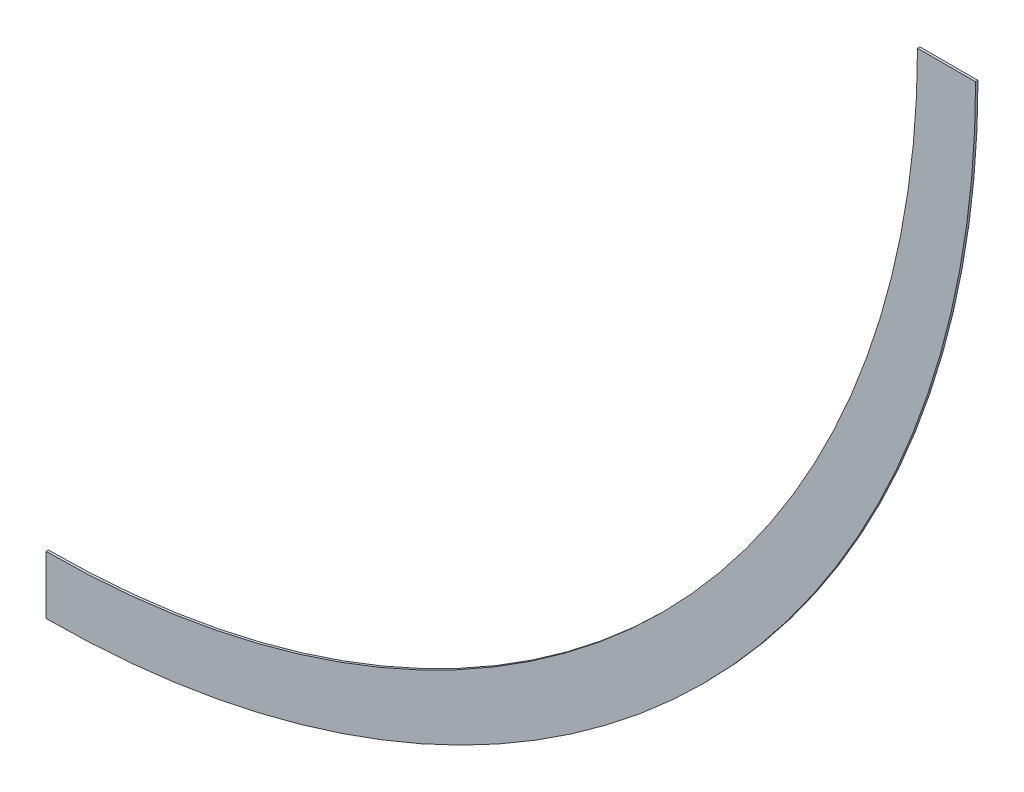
ISO-10303-21;
HEADER;
FILE_DESCRIPTION(('STEP AP214'),'2;1');
FILE_NAME('part.step','',(''),(''),'','','');
FILE_SCHEMA(('AUTOMOTIVE_DESIGN { 1 0 10303 214 1 1 1 1 }'));
ENDSEC;
DATA;
#1=APPLICATION_CONTEXT('core data for automotive mechanical design processes');
#2=APPLICATION_PROTOCOL_DEFINITION('international standard','automotive_design',2000,#1);
#3=PRODUCT_CONTEXT('',#1,'mechanical');
#4=PRODUCT('Part','Part','',(#3));
#5=PRODUCT_RELATED_PRODUCT_CATEGORY('part','',(#4));
#6=PRODUCT_DEFINITION_FORMATION('','',#4);
#7=PRODUCT_DEFINITION_CONTEXT('part definition',#1,'design');
#8=PRODUCT_DEFINITION('design','',#6,#7);
#9=PRODUCT_DEFINITION_SHAPE('','',#8);
#10=(LENGTH_UNIT() NAMED_UNIT(*) SI_UNIT(.MILLI.,.METRE.));
#11=(NAMED_UNIT(*) PLANE_ANGLE_UNIT() SI_UNIT($,.RADIAN.));
#12=(NAMED_UNIT(*) SI_UNIT($,.STERADIAN.) SOLID_ANGLE_UNIT());
#13=UNCERTAINTY_MEASURE_WITH_UNIT(LENGTH_MEASURE(1.E-05),#10,'distance_accuracy_value','');
#14=(GEOMETRIC_REPRESENTATION_CONTEXT(3) GLOBAL_UNCERTAINTY_ASSIGNED_CONTEXT((#13)) GLOBAL_UNIT_ASSIGNED_CONTEXT((#10,
#11,#12)) REPRESENTATION_CONTEXT('',''));
#15=CARTESIAN_POINT('',(0.,0.,0.));
#16=DIRECTION('',(0.,0.,1.));
#17=DIRECTION('',(1.,0.,0.));
#18=AXIS2_PLACEMENT_3D('',#15,#16,#17);
#19=CARTESIAN_POINT('',(0.,1.49931058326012E-13,1.5875));
#20=DIRECTION('',(0.,0.,-1.));
#21=DIRECTION('',(-1.,0.,0.));
#22=AXIS2_PLACEMENT_3D('',#19,#20,#21);
#23=CYLINDRICAL_SURFACE('',#22,1219.5175);
#24=CARTESIAN_POINT('',(0.,1.49931058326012E-13,-1.5875));
#25=DIRECTION('',(0.,0.,1.));
#26=DIRECTION('',(1.,0.,0.));
#27=AXIS2_PLACEMENT_3D('',#24,#25,#26);
#28=CIRCLE('',#27,1219.5175);
#29=CARTESIAN_POINT('',(0.,-1219.5175,-1.5875));
#30=VERTEX_POINT('',#29);
#31=CARTESIAN_POINT('',(1219.5175,0.,-1.5875));
#32=VERTEX_POINT('',#31);
#33=EDGE_CURVE('E100',#30,#32,#28,.T.);
#34=ORIENTED_EDGE('',*,*,#33,.T.);
#35=DIRECTION('',(0.,0.,-1.));
#36=VECTOR('',#35,1.);
#37=CARTESIAN_POINT('',(1219.5175,1.49931058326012E-13,1.5875));
#38=LINE('',#37,#36);
#39=CARTESIAN_POINT('',(1219.5175,0.,1.5875));
#40=VERTEX_POINT('',#39);
#41=EDGE_CURVE('E86',#40,#32,#38,.T.);
#42=ORIENTED_EDGE('',*,*,#41,.F.);
#43=CARTESIAN_POINT('',(0.,1.49931058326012E-13,1.5875));
#44=DIRECTION('',(0.,0.,1.));
#45=DIRECTION('',(1.,0.,0.));
#46=AXIS2_PLACEMENT_3D('',#43,#44,#45);
#47=CIRCLE('',#46,1219.5175);
#48=CARTESIAN_POINT('',(0.,-1219.5175,1.5875));
#49=VERTEX_POINT('',#48);
#50=EDGE_CURVE('E93',#49,#40,#47,.T.);
#51=ORIENTED_EDGE('',*,*,#50,.F.);
#52=DIRECTION('',(0.,0.,-1.));
#53=VECTOR('',#52,1.);
#54=CARTESIAN_POINT('',(-1.49347820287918E-13,-1219.5175,1.5875));
#55=LINE('',#54,#53);
#56=EDGE_CURVE('E50',#49,#30,#55,.T.);
#57=ORIENTED_EDGE('',*,*,#56,.T.);
#58=EDGE_LOOP('',(#34,#42,#51,#57));
#59=FACE_BOUND('',#58,.T.);
#60=ADVANCED_FACE('F42',(#59),#23,.T.);
#61=CARTESIAN_POINT('',(0.,1.49931058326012E-13,1.5875));
#62=DIRECTION('',(0.,0.,-1.));
#63=DIRECTION('',(-1.,0.,0.));
#64=AXIS2_PLACEMENT_3D('',#61,#62,#63);
#65=CYLINDRICAL_SURFACE('',#64,1143.3175);
#66=CARTESIAN_POINT('',(0.,1.49931058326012E-13,-1.5875));
#67=DIRECTION('',(0.,0.,-1.));
#68=DIRECTION('',(1.,0.,0.));
#69=AXIS2_PLACEMENT_3D('',#66,#67,#68);
#70=CIRCLE('',#69,1143.3175);
#71=CARTESIAN_POINT('',(1143.3175,0.,-1.5875));
#72=VERTEX_POINT('',#71);
#73=CARTESIAN_POINT('',(0.,-1143.3175,-1.5875));
#74=VERTEX_POINT('',#73);
#75=EDGE_CURVE('E101',#72,#74,#70,.T.);
#76=ORIENTED_EDGE('',*,*,#75,.T.);
#77=DIRECTION('',(0.,0.,-1.));
#78=VECTOR('',#77,1.);
#79=CARTESIAN_POINT('',(-2.10024017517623E-13,-1143.3175,1.5875));
#80=LINE('',#79,#78);
#81=CARTESIAN_POINT('',(-2.10024017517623E-13,-1143.3175,1.5875));
#82=VERTEX_POINT('',#81);
#83=EDGE_CURVE('E110',#82,#74,#80,.T.);
#84=ORIENTED_EDGE('',*,*,#83,.F.);
#85=CARTESIAN_POINT('',(0.,1.49931058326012E-13,1.5875));
#86=DIRECTION('',(0.,0.,-1.));
#87=DIRECTION('',(1.,0.,0.));
#88=AXIS2_PLACEMENT_3D('',#85,#86,#87);
#89=CIRCLE('',#88,1143.3175);
#90=CARTESIAN_POINT('',(1143.3175,0.,1.5875));
#91=VERTEX_POINT('',#90);
#92=EDGE_CURVE('E98',#91,#82,#89,.T.);
#93=ORIENTED_EDGE('',*,*,#92,.F.);
#94=DIRECTION('',(0.,0.,-1.));
#95=VECTOR('',#94,1.);
#96=CARTESIAN_POINT('',(1143.3175,0.,1.5875));
#97=LINE('',#96,#95);
#98=EDGE_CURVE('E120',#91,#72,#97,.T.);
#99=ORIENTED_EDGE('',*,*,#98,.T.);
#100=EDGE_LOOP('',(#76,#84,#93,#99));
#101=FACE_BOUND('',#100,.T.);
#102=ADVANCED_FACE('F127',(#101),#65,.F.);
#103=CARTESIAN_POINT('',(0.,1.49931058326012E-13,1.5875));
#104=DIRECTION('',(0.,0.,1.));
#105=DIRECTION('',(1.,0.,0.));
#106=AXIS2_PLACEMENT_3D('',#103,#104,#105);
#107=PLANE('',#106);
#108=DIRECTION('',(1.,0.,0.));
#109=VECTOR('',#108,1.);
#110=CARTESIAN_POINT('',(1309.90471517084,0.,1.5875));
#111=LINE('',#110,#109);
#112=EDGE_CURVE('E99',#91,#40,#111,.T.);
#113=ORIENTED_EDGE('',*,*,#112,.F.);
#114=ORIENTED_EDGE('',*,*,#92,.T.);
#115=DIRECTION('',(0.,1.,0.));
#116=VECTOR('',#115,1.);
#117=CARTESIAN_POINT('',(0.,-1294.29148033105,1.5875));
#118=LINE('',#117,#116);
#119=EDGE_CURVE('E61',#49,#82,#118,.T.);
#120=ORIENTED_EDGE('',*,*,#119,.F.);
#121=ORIENTED_EDGE('',*,*,#50,.T.);
#122=EDGE_LOOP('',(#113,#114,#120,#121));
#123=FACE_BOUND('',#122,.T.);
#124=ADVANCED_FACE('F95',(#123),#107,.T.);
#125=CARTESIAN_POINT('',(0.,1.49931058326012E-13,-1.5875));
#126=DIRECTION('',(0.,0.,1.));
#127=DIRECTION('',(1.,0.,0.));
#128=AXIS2_PLACEMENT_3D('',#125,#126,#127);
#129=PLANE('',#128);
#130=ORIENTED_EDGE('',*,*,#75,.F.);
#131=DIRECTION('',(1.,0.,0.));
#132=VECTOR('',#131,1.);
#133=CARTESIAN_POINT('',(1309.90471517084,0.,-1.5875));
#134=LINE('',#133,#132);
#135=EDGE_CURVE('E11',#72,#32,#134,.T.);
#136=ORIENTED_EDGE('',*,*,#135,.T.);
#137=ORIENTED_EDGE('',*,*,#33,.F.);
#138=DIRECTION('',(0.,1.,0.));
#139=VECTOR('',#138,1.);
#140=CARTESIAN_POINT('',(0.,-1294.29148033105,-1.5875));
#141=LINE('',#140,#139);
#142=EDGE_CURVE('E53',#30,#74,#141,.T.);
#143=ORIENTED_EDGE('',*,*,#142,.T.);
#144=EDGE_LOOP('',(#130,#136,#137,#143));
#145=FACE_BOUND('',#144,.T.);
#146=ADVANCED_FACE('F123',(#145),#129,.F.);
#147=CARTESIAN_POINT('',(0.,-1294.29148033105,-1.5875));
#148=DIRECTION('',(1.,0.,0.));
#149=DIRECTION('',(0.,0.,-1.));
#150=AXIS2_PLACEMENT_3D('',#147,#148,#149);
#151=PLANE('',#150);
#152=ORIENTED_EDGE('',*,*,#119,.T.);
#153=ORIENTED_EDGE('',*,*,#83,.T.);
#154=ORIENTED_EDGE('',*,*,#142,.F.);
#155=ORIENTED_EDGE('',*,*,#56,.F.);
#156=EDGE_LOOP('',(#152,#153,#154,#155));
#157=FACE_BOUND('',#156,.T.);
#158=ADVANCED_FACE('F81',(#157),#151,.F.);
#159=CARTESIAN_POINT('',(1309.90471517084,0.,-1.5875));
#160=DIRECTION('',(0.,-1.,0.));
#161=DIRECTION('',(0.,0.,-1.));
#162=AXIS2_PLACEMENT_3D('',#159,#160,#161);
#163=PLANE('',#162);
#164=ORIENTED_EDGE('',*,*,#135,.F.);
#165=ORIENTED_EDGE('',*,*,#98,.F.);
#166=ORIENTED_EDGE('',*,*,#112,.T.);
#167=ORIENTED_EDGE('',*,*,#41,.T.);
#168=EDGE_LOOP('',(#164,#165,#166,#167));
#169=FACE_BOUND('',#168,.T.);
#170=ADVANCED_FACE('F125',(#169),#163,.F.);
#171=CLOSED_SHELL('',(#60,#102,#124,#146,#158,#170));
#172=MANIFOLD_SOLID_BREP('B2',#171);
#173=ADVANCED_BREP_SHAPE_REPRESENTATION('',(#18,#172),#14);
#174=SHAPE_DEFINITION_REPRESENTATION(#9,#173);
ENDSEC;
END-ISO-10303-21;
